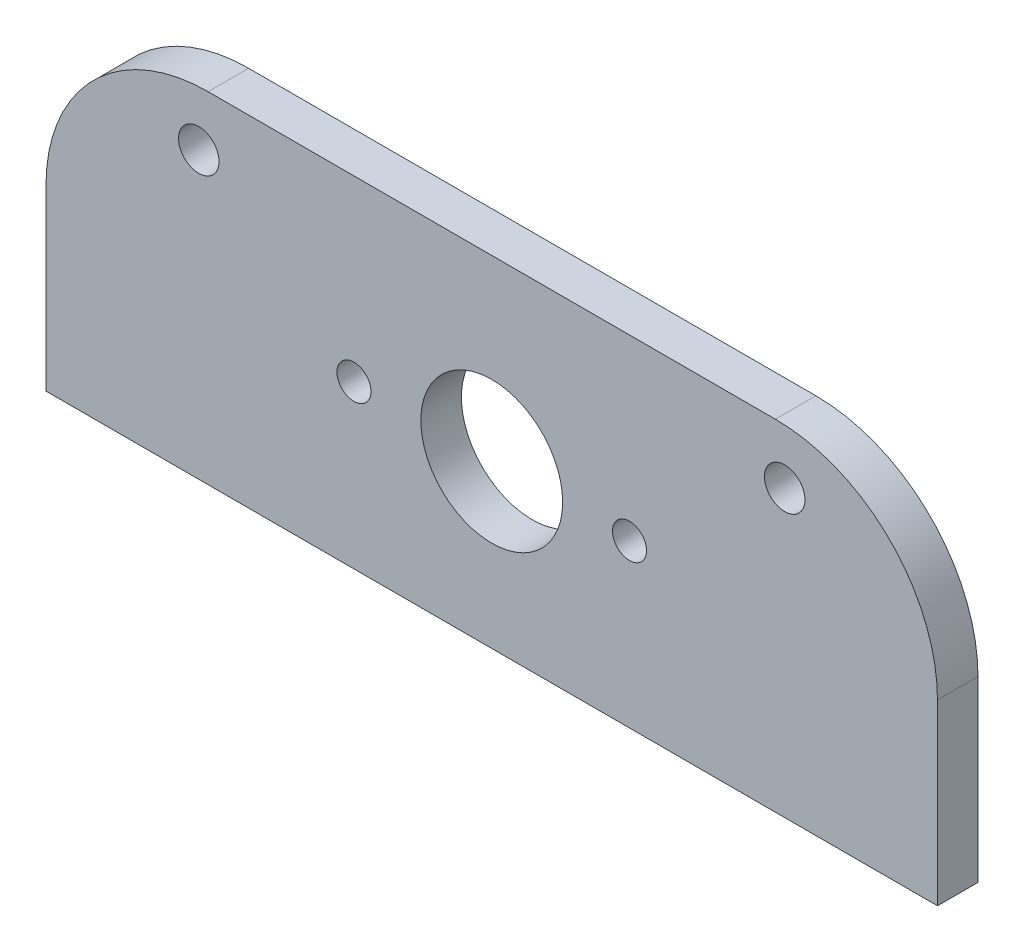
ISO-10303-21;
HEADER;
FILE_DESCRIPTION(('STEP AP214'),'2;1');
FILE_NAME('part.step','',(''),(''),'','','');
FILE_SCHEMA(('AUTOMOTIVE_DESIGN { 1 0 10303 214 1 1 1 1 }'));
ENDSEC;
DATA;
#1=APPLICATION_CONTEXT('core data for automotive mechanical design processes');
#2=APPLICATION_PROTOCOL_DEFINITION('international standard','automotive_design',2000,#1);
#3=PRODUCT_CONTEXT('',#1,'mechanical');
#4=PRODUCT('Part','Part','',(#3));
#5=PRODUCT_RELATED_PRODUCT_CATEGORY('part','',(#4));
#6=PRODUCT_DEFINITION_FORMATION('','',#4);
#7=PRODUCT_DEFINITION_CONTEXT('part definition',#1,'design');
#8=PRODUCT_DEFINITION('design','',#6,#7);
#9=PRODUCT_DEFINITION_SHAPE('','',#8);
#10=(LENGTH_UNIT() NAMED_UNIT(*) SI_UNIT(.MILLI.,.METRE.));
#11=(NAMED_UNIT(*) PLANE_ANGLE_UNIT() SI_UNIT($,.RADIAN.));
#12=(NAMED_UNIT(*) SI_UNIT($,.STERADIAN.) SOLID_ANGLE_UNIT());
#13=UNCERTAINTY_MEASURE_WITH_UNIT(LENGTH_MEASURE(1.E-05),#10,'distance_accuracy_value','');
#14=(GEOMETRIC_REPRESENTATION_CONTEXT(3) GLOBAL_UNCERTAINTY_ASSIGNED_CONTEXT((#13)) GLOBAL_UNIT_ASSIGNED_CONTEXT((#10,
#11,#12)) REPRESENTATION_CONTEXT('',''));
#15=CARTESIAN_POINT('',(0.,0.,0.));
#16=DIRECTION('',(0.,0.,1.));
#17=DIRECTION('',(1.,0.,0.));
#18=AXIS2_PLACEMENT_3D('',#15,#16,#17);
#19=CARTESIAN_POINT('',(0.,0.,2.5));
#20=DIRECTION('',(0.,0.,1.));
#21=DIRECTION('',(1.,0.,0.));
#22=AXIS2_PLACEMENT_3D('',#19,#20,#21);
#23=PLANE('',#22);
#24=CARTESIAN_POINT('',(-17.,0.,2.5));
#25=DIRECTION('',(0.,0.,1.));
#26=DIRECTION('',(1.,0.,0.));
#27=AXIS2_PLACEMENT_3D('',#24,#25,#26);
#28=CIRCLE('',#27,2.1);
#29=CARTESIAN_POINT('',(-14.9,0.,2.5));
#30=VERTEX_POINT('',#29);
#31=EDGE_CURVE('E424',#30,#30,#28,.T.);
#32=ORIENTED_EDGE('',*,*,#31,.F.);
#33=EDGE_LOOP('',(#32));
#34=FACE_BOUND('',#33,.T.);
#35=CARTESIAN_POINT('',(17.,0.,2.5));
#36=DIRECTION('',(0.,0.,1.));
#37=DIRECTION('',(1.,0.,0.));
#38=AXIS2_PLACEMENT_3D('',#35,#36,#37);
#39=CIRCLE('',#38,2.1);
#40=CARTESIAN_POINT('',(19.1,0.,2.5));
#41=VERTEX_POINT('',#40);
#42=EDGE_CURVE('E426',#41,#41,#39,.T.);
#43=ORIENTED_EDGE('',*,*,#42,.F.);
#44=EDGE_LOOP('',(#43));
#45=FACE_BOUND('',#44,.T.);
#46=CARTESIAN_POINT('',(-36.15,15.2,2.5));
#47=DIRECTION('',(0.,0.,1.));
#48=DIRECTION('',(1.,0.,0.));
#49=AXIS2_PLACEMENT_3D('',#46,#47,#48);
#50=CIRCLE('',#49,2.5);
#51=CARTESIAN_POINT('',(-33.65,15.2,2.5));
#52=VERTEX_POINT('',#51);
#53=EDGE_CURVE('E147',#52,#52,#50,.T.);
#54=ORIENTED_EDGE('',*,*,#53,.F.);
#55=EDGE_LOOP('',(#54));
#56=FACE_BOUND('',#55,.T.);
#57=DIRECTION('',(0.,1.,0.));
#58=VECTOR('',#57,1.);
#59=CARTESIAN_POINT('',(55.,22.,2.5));
#60=LINE('',#59,#58);
#61=CARTESIAN_POINT('',(55.,-20.,2.5));
#62=VERTEX_POINT('',#61);
#63=CARTESIAN_POINT('',(55.,2.00000000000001,2.5));
#64=VERTEX_POINT('',#63);
#65=EDGE_CURVE('E164',#62,#64,#60,.T.);
#66=ORIENTED_EDGE('',*,*,#65,.T.);
#67=CARTESIAN_POINT('',(35.,2.00000000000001,2.5));
#68=DIRECTION('',(0.,0.,1.));
#69=DIRECTION('',(1.,0.,0.));
#70=AXIS2_PLACEMENT_3D('',#67,#68,#69);
#71=CIRCLE('',#70,20.);
#72=CARTESIAN_POINT('',(35.,22.,2.5));
#73=VERTEX_POINT('',#72);
#74=EDGE_CURVE('E47',#64,#73,#71,.T.);
#75=ORIENTED_EDGE('',*,*,#74,.T.);
#76=DIRECTION('',(-1.,0.,0.));
#77=VECTOR('',#76,1.);
#78=CARTESIAN_POINT('',(-55.,22.,2.5));
#79=LINE('',#78,#77);
#80=CARTESIAN_POINT('',(-35.,22.,2.5));
#81=VERTEX_POINT('',#80);
#82=EDGE_CURVE('E166',#73,#81,#79,.T.);
#83=ORIENTED_EDGE('',*,*,#82,.T.);
#84=CARTESIAN_POINT('',(-35.,2.,2.5));
#85=DIRECTION('',(0.,0.,1.));
#86=DIRECTION('',(1.,0.,0.));
#87=AXIS2_PLACEMENT_3D('',#84,#85,#86);
#88=CIRCLE('',#87,20.);
#89=CARTESIAN_POINT('',(-55.,1.99999999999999,2.5));
#90=VERTEX_POINT('',#89);
#91=EDGE_CURVE('E54',#81,#90,#88,.T.);
#92=ORIENTED_EDGE('',*,*,#91,.T.);
#93=DIRECTION('',(0.,-1.,0.));
#94=VECTOR('',#93,1.);
#95=CARTESIAN_POINT('',(-55.,22.,2.5));
#96=LINE('',#95,#94);
#97=CARTESIAN_POINT('',(-55.,-20.,2.5));
#98=VERTEX_POINT('',#97);
#99=EDGE_CURVE('E159',#90,#98,#96,.T.);
#100=ORIENTED_EDGE('',*,*,#99,.T.);
#101=DIRECTION('',(1.,0.,0.));
#102=VECTOR('',#101,1.);
#103=CARTESIAN_POINT('',(-55.,-20.,2.5));
#104=LINE('',#103,#102);
#105=EDGE_CURVE('E161',#98,#62,#104,.T.);
#106=ORIENTED_EDGE('',*,*,#105,.T.);
#107=EDGE_LOOP('',(#66,#75,#83,#92,#100,#106));
#108=FACE_BOUND('',#107,.T.);
#109=CARTESIAN_POINT('',(0.,0.,2.5));
#110=DIRECTION('',(0.,0.,1.));
#111=DIRECTION('',(1.,0.,0.));
#112=AXIS2_PLACEMENT_3D('',#109,#110,#111);
#113=CIRCLE('',#112,8.75);
#114=CARTESIAN_POINT('',(8.75,0.,2.5));
#115=VERTEX_POINT('',#114);
#116=EDGE_CURVE('E153',#115,#115,#113,.T.);
#117=ORIENTED_EDGE('',*,*,#116,.F.);
#118=EDGE_LOOP('',(#117));
#119=FACE_BOUND('',#118,.T.);
#120=CARTESIAN_POINT('',(36.15,15.2,2.5));
#121=DIRECTION('',(0.,0.,1.));
#122=DIRECTION('',(1.,0.,0.));
#123=AXIS2_PLACEMENT_3D('',#120,#121,#122);
#124=CIRCLE('',#123,2.5);
#125=CARTESIAN_POINT('',(38.65,15.2,2.5));
#126=VERTEX_POINT('',#125);
#127=EDGE_CURVE('E141',#126,#126,#124,.T.);
#128=ORIENTED_EDGE('',*,*,#127,.F.);
#129=EDGE_LOOP('',(#128));
#130=FACE_BOUND('',#129,.T.);
#131=ADVANCED_FACE('F39',(#34,#45,#56,#108,#119,#130),#23,.T.);
#132=CARTESIAN_POINT('',(0.,0.,-2.5));
#133=DIRECTION('',(0.,0.,1.));
#134=DIRECTION('',(1.,0.,0.));
#135=AXIS2_PLACEMENT_3D('',#132,#133,#134);
#136=PLANE('',#135);
#137=CARTESIAN_POINT('',(-17.,0.,-2.5));
#138=DIRECTION('',(0.,0.,1.));
#139=DIRECTION('',(1.,0.,0.));
#140=AXIS2_PLACEMENT_3D('',#137,#138,#139);
#141=CIRCLE('',#140,2.1);
#142=CARTESIAN_POINT('',(-14.9,0.,-2.5));
#143=VERTEX_POINT('',#142);
#144=EDGE_CURVE('E422',#143,#143,#141,.T.);
#145=ORIENTED_EDGE('',*,*,#144,.T.);
#146=EDGE_LOOP('',(#145));
#147=FACE_BOUND('',#146,.T.);
#148=CARTESIAN_POINT('',(17.,0.,-2.5));
#149=DIRECTION('',(0.,0.,1.));
#150=DIRECTION('',(1.,0.,0.));
#151=AXIS2_PLACEMENT_3D('',#148,#149,#150);
#152=CIRCLE('',#151,2.1);
#153=CARTESIAN_POINT('',(19.1,0.,-2.5));
#154=VERTEX_POINT('',#153);
#155=EDGE_CURVE('E122',#154,#154,#152,.T.);
#156=ORIENTED_EDGE('',*,*,#155,.T.);
#157=EDGE_LOOP('',(#156));
#158=FACE_BOUND('',#157,.T.);
#159=DIRECTION('',(-1.,0.,0.));
#160=VECTOR('',#159,1.);
#161=CARTESIAN_POINT('',(-55.,22.,-2.5));
#162=LINE('',#161,#160);
#163=CARTESIAN_POINT('',(35.,22.,-2.5));
#164=VERTEX_POINT('',#163);
#165=CARTESIAN_POINT('',(-35.,22.,-2.5));
#166=VERTEX_POINT('',#165);
#167=EDGE_CURVE('E162',#164,#166,#162,.T.);
#168=ORIENTED_EDGE('',*,*,#167,.F.);
#169=CARTESIAN_POINT('',(35.,2.00000000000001,-2.5));
#170=DIRECTION('',(0.,0.,1.));
#171=DIRECTION('',(1.,0.,0.));
#172=AXIS2_PLACEMENT_3D('',#169,#170,#171);
#173=CIRCLE('',#172,20.);
#174=CARTESIAN_POINT('',(55.,2.00000000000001,-2.5));
#175=VERTEX_POINT('',#174);
#176=EDGE_CURVE('E188',#164,#175,#173,.F.);
#177=ORIENTED_EDGE('',*,*,#176,.T.);
#178=DIRECTION('',(0.,1.,0.));
#179=VECTOR('',#178,1.);
#180=CARTESIAN_POINT('',(55.,22.,-2.5));
#181=LINE('',#180,#179);
#182=CARTESIAN_POINT('',(55.,-20.,-2.5));
#183=VERTEX_POINT('',#182);
#184=EDGE_CURVE('E172',#183,#175,#181,.T.);
#185=ORIENTED_EDGE('',*,*,#184,.F.);
#186=DIRECTION('',(1.,0.,0.));
#187=VECTOR('',#186,1.);
#188=CARTESIAN_POINT('',(-55.,-20.,-2.5));
#189=LINE('',#188,#187);
#190=CARTESIAN_POINT('',(-55.,-20.,-2.5));
#191=VERTEX_POINT('',#190);
#192=EDGE_CURVE('E170',#191,#183,#189,.T.);
#193=ORIENTED_EDGE('',*,*,#192,.F.);
#194=DIRECTION('',(0.,-1.,0.));
#195=VECTOR('',#194,1.);
#196=CARTESIAN_POINT('',(-55.,22.,-2.5));
#197=LINE('',#196,#195);
#198=CARTESIAN_POINT('',(-55.,1.99999999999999,-2.5));
#199=VERTEX_POINT('',#198);
#200=EDGE_CURVE('E156',#199,#191,#197,.T.);
#201=ORIENTED_EDGE('',*,*,#200,.F.);
#202=CARTESIAN_POINT('',(-35.,2.,-2.5));
#203=DIRECTION('',(0.,0.,1.));
#204=DIRECTION('',(1.,0.,0.));
#205=AXIS2_PLACEMENT_3D('',#202,#203,#204);
#206=CIRCLE('',#205,20.);
#207=EDGE_CURVE('E186',#199,#166,#206,.F.);
#208=ORIENTED_EDGE('',*,*,#207,.T.);
#209=EDGE_LOOP('',(#168,#177,#185,#193,#201,#208));
#210=FACE_BOUND('',#209,.T.);
#211=CARTESIAN_POINT('',(0.,0.,-2.5));
#212=DIRECTION('',(0.,0.,1.));
#213=DIRECTION('',(1.,0.,0.));
#214=AXIS2_PLACEMENT_3D('',#211,#212,#213);
#215=CIRCLE('',#214,8.75);
#216=CARTESIAN_POINT('',(8.75,0.,-2.5));
#217=VERTEX_POINT('',#216);
#218=EDGE_CURVE('E150',#217,#217,#215,.T.);
#219=ORIENTED_EDGE('',*,*,#218,.T.);
#220=EDGE_LOOP('',(#219));
#221=FACE_BOUND('',#220,.T.);
#222=CARTESIAN_POINT('',(-36.15,15.2,-2.5));
#223=DIRECTION('',(0.,0.,1.));
#224=DIRECTION('',(1.,0.,0.));
#225=AXIS2_PLACEMENT_3D('',#222,#223,#224);
#226=CIRCLE('',#225,2.5);
#227=CARTESIAN_POINT('',(-33.65,15.2,-2.5));
#228=VERTEX_POINT('',#227);
#229=EDGE_CURVE('E144',#228,#228,#226,.T.);
#230=ORIENTED_EDGE('',*,*,#229,.T.);
#231=EDGE_LOOP('',(#230));
#232=FACE_BOUND('',#231,.T.);
#233=CARTESIAN_POINT('',(36.15,15.2,-2.5));
#234=DIRECTION('',(0.,0.,1.));
#235=DIRECTION('',(1.,0.,0.));
#236=AXIS2_PLACEMENT_3D('',#233,#234,#235);
#237=CIRCLE('',#236,2.5);
#238=CARTESIAN_POINT('',(38.65,15.2,-2.5));
#239=VERTEX_POINT('',#238);
#240=EDGE_CURVE('E140',#239,#239,#237,.T.);
#241=ORIENTED_EDGE('',*,*,#240,.T.);
#242=EDGE_LOOP('',(#241));
#243=FACE_BOUND('',#242,.T.);
#244=ADVANCED_FACE('F203',(#147,#158,#210,#221,#232,#243),#136,.F.);
#245=CARTESIAN_POINT('',(-55.,22.,2.5));
#246=DIRECTION('',(1.,0.,0.));
#247=DIRECTION('',(0.,1.,0.));
#248=AXIS2_PLACEMENT_3D('',#245,#246,#247);
#249=PLANE('',#248);
#250=ORIENTED_EDGE('',*,*,#99,.F.);
#251=DIRECTION('',(0.,0.,-1.));
#252=VECTOR('',#251,1.);
#253=CARTESIAN_POINT('',(-55.,1.99999999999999,2.5));
#254=LINE('',#253,#252);
#255=EDGE_CURVE('E11',#90,#199,#254,.T.);
#256=ORIENTED_EDGE('',*,*,#255,.T.);
#257=ORIENTED_EDGE('',*,*,#200,.T.);
#258=DIRECTION('',(0.,0.,-1.));
#259=VECTOR('',#258,1.);
#260=CARTESIAN_POINT('',(-55.,-20.,2.5));
#261=LINE('',#260,#259);
#262=EDGE_CURVE('E178',#98,#191,#261,.T.);
#263=ORIENTED_EDGE('',*,*,#262,.F.);
#264=EDGE_LOOP('',(#250,#256,#257,#263));
#265=FACE_BOUND('',#264,.T.);
#266=ADVANCED_FACE('F214',(#265),#249,.F.);
#267=CARTESIAN_POINT('',(-55.,-20.,2.5));
#268=DIRECTION('',(0.,1.,0.));
#269=DIRECTION('',(-1.,0.,0.));
#270=AXIS2_PLACEMENT_3D('',#267,#268,#269);
#271=PLANE('',#270);
#272=CARTESIAN_POINT('',(33.5,-20.,0.));
#273=DIRECTION('',(0.,-1.,0.));
#274=DIRECTION('',(0.,0.,-1.));
#275=AXIS2_PLACEMENT_3D('',#272,#273,#274);
#276=CIRCLE('',#275,1.64999999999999);
#277=CARTESIAN_POINT('',(33.5,-20.,-1.64999999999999));
#278=VERTEX_POINT('',#277);
#279=EDGE_CURVE('E116',#278,#278,#276,.T.);
#280=ORIENTED_EDGE('',*,*,#279,.F.);
#281=EDGE_LOOP('',(#280));
#282=FACE_BOUND('',#281,.T.);
#283=CARTESIAN_POINT('',(-33.5,-20.,0.));
#284=DIRECTION('',(0.,-1.,0.));
#285=DIRECTION('',(0.,0.,-1.));
#286=AXIS2_PLACEMENT_3D('',#283,#284,#285);
#287=CIRCLE('',#286,1.64999999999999);
#288=CARTESIAN_POINT('',(-33.5,-20.,-1.64999999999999));
#289=VERTEX_POINT('',#288);
#290=EDGE_CURVE('E115',#289,#289,#287,.T.);
#291=ORIENTED_EDGE('',*,*,#290,.F.);
#292=EDGE_LOOP('',(#291));
#293=FACE_BOUND('',#292,.T.);
#294=CARTESIAN_POINT('',(20.,-20.,0.));
#295=DIRECTION('',(0.,-1.,0.));
#296=DIRECTION('',(0.,0.,-1.));
#297=AXIS2_PLACEMENT_3D('',#294,#295,#296);
#298=CIRCLE('',#297,1.99999999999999);
#299=CARTESIAN_POINT('',(20.,-20.,-1.99999999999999));
#300=VERTEX_POINT('',#299);
#301=EDGE_CURVE('E128',#300,#300,#298,.T.);
#302=ORIENTED_EDGE('',*,*,#301,.F.);
#303=EDGE_LOOP('',(#302));
#304=FACE_BOUND('',#303,.T.);
#305=CARTESIAN_POINT('',(-20.,-20.,0.));
#306=DIRECTION('',(0.,-1.,0.));
#307=DIRECTION('',(0.,0.,-1.));
#308=AXIS2_PLACEMENT_3D('',#305,#306,#307);
#309=CIRCLE('',#308,1.99999999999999);
#310=CARTESIAN_POINT('',(-20.,-20.,-1.99999999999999));
#311=VERTEX_POINT('',#310);
#312=EDGE_CURVE('E134',#311,#311,#309,.T.);
#313=ORIENTED_EDGE('',*,*,#312,.F.);
#314=EDGE_LOOP('',(#313));
#315=FACE_BOUND('',#314,.T.);
#316=ORIENTED_EDGE('',*,*,#192,.T.);
#317=DIRECTION('',(0.,0.,-1.));
#318=VECTOR('',#317,1.);
#319=CARTESIAN_POINT('',(55.,-20.,2.5));
#320=LINE('',#319,#318);
#321=EDGE_CURVE('E168',#62,#183,#320,.T.);
#322=ORIENTED_EDGE('',*,*,#321,.F.);
#323=ORIENTED_EDGE('',*,*,#105,.F.);
#324=ORIENTED_EDGE('',*,*,#262,.T.);
#325=EDGE_LOOP('',(#316,#322,#323,#324));
#326=FACE_BOUND('',#325,.T.);
#327=ADVANCED_FACE('F210',(#282,#293,#304,#315,#326),#271,.F.);
#328=CARTESIAN_POINT('',(55.,22.,2.5));
#329=DIRECTION('',(-1.,0.,0.));
#330=DIRECTION('',(0.,0.,1.));
#331=AXIS2_PLACEMENT_3D('',#328,#329,#330);
#332=PLANE('',#331);
#333=ORIENTED_EDGE('',*,*,#184,.T.);
#334=DIRECTION('',(0.,0.,-1.));
#335=VECTOR('',#334,1.);
#336=CARTESIAN_POINT('',(55.,2.00000000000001,2.5));
#337=LINE('',#336,#335);
#338=EDGE_CURVE('E62',#175,#64,#337,.F.);
#339=ORIENTED_EDGE('',*,*,#338,.T.);
#340=ORIENTED_EDGE('',*,*,#65,.F.);
#341=ORIENTED_EDGE('',*,*,#321,.T.);
#342=EDGE_LOOP('',(#333,#339,#340,#341));
#343=FACE_BOUND('',#342,.T.);
#344=ADVANCED_FACE('F206',(#343),#332,.F.);
#345=CARTESIAN_POINT('',(-55.,22.,2.5));
#346=DIRECTION('',(0.,-1.,0.));
#347=DIRECTION('',(1.,0.,0.));
#348=AXIS2_PLACEMENT_3D('',#345,#346,#347);
#349=PLANE('',#348);
#350=ORIENTED_EDGE('',*,*,#82,.F.);
#351=DIRECTION('',(0.,0.,-1.));
#352=VECTOR('',#351,1.);
#353=CARTESIAN_POINT('',(35.,22.,2.5));
#354=LINE('',#353,#352);
#355=EDGE_CURVE('E183',#73,#164,#354,.T.);
#356=ORIENTED_EDGE('',*,*,#355,.T.);
#357=ORIENTED_EDGE('',*,*,#167,.T.);
#358=DIRECTION('',(0.,0.,-1.));
#359=VECTOR('',#358,1.);
#360=CARTESIAN_POINT('',(-35.,22.,2.5));
#361=LINE('',#360,#359);
#362=EDGE_CURVE('E181',#166,#81,#361,.F.);
#363=ORIENTED_EDGE('',*,*,#362,.T.);
#364=EDGE_LOOP('',(#350,#356,#357,#363));
#365=FACE_BOUND('',#364,.T.);
#366=ADVANCED_FACE('F197',(#365),#349,.F.);
#367=CARTESIAN_POINT('',(0.,0.,2.5));
#368=DIRECTION('',(0.,0.,-1.));
#369=DIRECTION('',(-1.,0.,0.));
#370=AXIS2_PLACEMENT_3D('',#367,#368,#369);
#371=CYLINDRICAL_SURFACE('',#370,8.75);
#372=ORIENTED_EDGE('',*,*,#116,.T.);
#373=EDGE_LOOP('',(#372));
#374=FACE_BOUND('',#373,.T.);
#375=ORIENTED_EDGE('',*,*,#218,.F.);
#376=EDGE_LOOP('',(#375));
#377=FACE_BOUND('',#376,.T.);
#378=ADVANCED_FACE('F238',(#374,#377),#371,.F.);
#379=CARTESIAN_POINT('',(-36.15,15.2,2.5));
#380=DIRECTION('',(0.,0.,-1.));
#381=DIRECTION('',(-1.,0.,0.));
#382=AXIS2_PLACEMENT_3D('',#379,#380,#381);
#383=CYLINDRICAL_SURFACE('',#382,2.5);
#384=ORIENTED_EDGE('',*,*,#53,.T.);
#385=EDGE_LOOP('',(#384));
#386=FACE_BOUND('',#385,.T.);
#387=ORIENTED_EDGE('',*,*,#229,.F.);
#388=EDGE_LOOP('',(#387));
#389=FACE_BOUND('',#388,.T.);
#390=ADVANCED_FACE('F275',(#386,#389),#383,.F.);
#391=CARTESIAN_POINT('',(36.15,15.2,2.5));
#392=DIRECTION('',(0.,0.,-1.));
#393=DIRECTION('',(-1.,0.,0.));
#394=AXIS2_PLACEMENT_3D('',#391,#392,#393);
#395=CYLINDRICAL_SURFACE('',#394,2.5);
#396=ORIENTED_EDGE('',*,*,#127,.T.);
#397=EDGE_LOOP('',(#396));
#398=FACE_BOUND('',#397,.T.);
#399=ORIENTED_EDGE('',*,*,#240,.F.);
#400=EDGE_LOOP('',(#399));
#401=FACE_BOUND('',#400,.T.);
#402=ADVANCED_FACE('F226',(#398,#401),#395,.F.);
#403=CARTESIAN_POINT('',(35.,2.00000000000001,2.5));
#404=DIRECTION('',(0.,0.,-1.));
#405=DIRECTION('',(-1.,0.,0.));
#406=AXIS2_PLACEMENT_3D('',#403,#404,#405);
#407=CYLINDRICAL_SURFACE('',#406,20.);
#408=ORIENTED_EDGE('',*,*,#74,.F.);
#409=ORIENTED_EDGE('',*,*,#338,.F.);
#410=ORIENTED_EDGE('',*,*,#176,.F.);
#411=ORIENTED_EDGE('',*,*,#355,.F.);
#412=EDGE_LOOP('',(#408,#409,#410,#411));
#413=FACE_BOUND('',#412,.T.);
#414=ADVANCED_FACE('F200',(#413),#407,.T.);
#415=CARTESIAN_POINT('',(-35.,2.,2.5));
#416=DIRECTION('',(0.,0.,-1.));
#417=DIRECTION('',(-1.,0.,0.));
#418=AXIS2_PLACEMENT_3D('',#415,#416,#417);
#419=CYLINDRICAL_SURFACE('',#418,20.);
#420=ORIENTED_EDGE('',*,*,#91,.F.);
#421=ORIENTED_EDGE('',*,*,#362,.F.);
#422=ORIENTED_EDGE('',*,*,#207,.F.);
#423=ORIENTED_EDGE('',*,*,#255,.F.);
#424=EDGE_LOOP('',(#420,#421,#422,#423));
#425=FACE_BOUND('',#424,.T.);
#426=ADVANCED_FACE('F41',(#425),#419,.T.);
#427=CARTESIAN_POINT('',(-20.,-16.,0.));
#428=DIRECTION('',(0.,-1.,0.));
#429=DIRECTION('',(0.,0.,-1.));
#430=AXIS2_PLACEMENT_3D('',#427,#428,#429);
#431=CONICAL_SURFACE('',#430,2.,1.02974425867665);
#432=CARTESIAN_POINT('',(-20.,-14.7982787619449,0.));
#433=VERTEX_POINT('',#432);
#434=VERTEX_LOOP('',#433);
#435=FACE_BOUND('',#434,.T.);
#436=CARTESIAN_POINT('',(-20.,-16.,0.));
#437=DIRECTION('',(0.,-1.,0.));
#438=DIRECTION('',(0.,0.,-1.));
#439=AXIS2_PLACEMENT_3D('',#436,#437,#438);
#440=CIRCLE('',#439,2.);
#441=CARTESIAN_POINT('',(-20.,-16.,-2.));
#442=VERTEX_POINT('',#441);
#443=EDGE_CURVE('E137',#442,#442,#440,.T.);
#444=ORIENTED_EDGE('',*,*,#443,.T.);
#445=EDGE_LOOP('',(#444));
#446=FACE_BOUND('',#445,.T.);
#447=ADVANCED_FACE('F218',(#435,#446),#431,.F.);
#448=CARTESIAN_POINT('',(-20.,-20.,0.));
#449=DIRECTION('',(0.,-1.,0.));
#450=DIRECTION('',(0.,0.,-1.));
#451=AXIS2_PLACEMENT_3D('',#448,#449,#450);
#452=CYLINDRICAL_SURFACE('',#451,1.99999999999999);
#453=ORIENTED_EDGE('',*,*,#443,.F.);
#454=EDGE_LOOP('',(#453));
#455=FACE_BOUND('',#454,.T.);
#456=ORIENTED_EDGE('',*,*,#312,.T.);
#457=EDGE_LOOP('',(#456));
#458=FACE_BOUND('',#457,.T.);
#459=ADVANCED_FACE('F223',(#455,#458),#452,.F.);
#460=CARTESIAN_POINT('',(20.,-16.,0.));
#461=DIRECTION('',(0.,-1.,0.));
#462=DIRECTION('',(0.,0.,-1.));
#463=AXIS2_PLACEMENT_3D('',#460,#461,#462);
#464=CONICAL_SURFACE('',#463,2.,1.02974425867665);
#465=CARTESIAN_POINT('',(20.,-14.7982787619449,0.));
#466=VERTEX_POINT('',#465);
#467=VERTEX_LOOP('',#466);
#468=FACE_BOUND('',#467,.T.);
#469=CARTESIAN_POINT('',(20.,-16.,0.));
#470=DIRECTION('',(0.,-1.,0.));
#471=DIRECTION('',(0.,0.,-1.));
#472=AXIS2_PLACEMENT_3D('',#469,#470,#471);
#473=CIRCLE('',#472,2.);
#474=CARTESIAN_POINT('',(20.,-16.,-2.));
#475=VERTEX_POINT('',#474);
#476=EDGE_CURVE('E131',#475,#475,#473,.T.);
#477=ORIENTED_EDGE('',*,*,#476,.T.);
#478=EDGE_LOOP('',(#477));
#479=FACE_BOUND('',#478,.T.);
#480=ADVANCED_FACE('F310',(#468,#479),#464,.F.);
#481=CARTESIAN_POINT('',(20.,-20.,0.));
#482=DIRECTION('',(0.,-1.,0.));
#483=DIRECTION('',(0.,0.,-1.));
#484=AXIS2_PLACEMENT_3D('',#481,#482,#483);
#485=CYLINDRICAL_SURFACE('',#484,1.99999999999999);
#486=ORIENTED_EDGE('',*,*,#476,.F.);
#487=EDGE_LOOP('',(#486));
#488=FACE_BOUND('',#487,.T.);
#489=ORIENTED_EDGE('',*,*,#301,.T.);
#490=EDGE_LOOP('',(#489));
#491=FACE_BOUND('',#490,.T.);
#492=ADVANCED_FACE('F319',(#488,#491),#485,.F.);
#493=CARTESIAN_POINT('',(-33.5,-8.5,0.));
#494=DIRECTION('',(0.,-1.,0.));
#495=DIRECTION('',(0.,0.,-1.));
#496=AXIS2_PLACEMENT_3D('',#493,#494,#495);
#497=CONICAL_SURFACE('',#496,1.64999999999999,1.02974425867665);
#498=CARTESIAN_POINT('',(-33.5,-7.50857997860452,0.));
#499=VERTEX_POINT('',#498);
#500=VERTEX_LOOP('',#499);
#501=FACE_BOUND('',#500,.T.);
#502=CARTESIAN_POINT('',(-33.5,-8.5,0.));
#503=DIRECTION('',(0.,-1.,0.));
#504=DIRECTION('',(0.,0.,-1.));
#505=AXIS2_PLACEMENT_3D('',#502,#503,#504);
#506=CIRCLE('',#505,1.64999999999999);
#507=CARTESIAN_POINT('',(-33.5,-8.5,-1.64999999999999));
#508=VERTEX_POINT('',#507);
#509=EDGE_CURVE('E119',#508,#508,#506,.T.);
#510=ORIENTED_EDGE('',*,*,#509,.T.);
#511=EDGE_LOOP('',(#510));
#512=FACE_BOUND('',#511,.T.);
#513=ADVANCED_FACE('F328',(#501,#512),#497,.F.);
#514=CARTESIAN_POINT('',(-33.5,-20.,0.));
#515=DIRECTION('',(0.,-1.,0.));
#516=DIRECTION('',(0.,0.,-1.));
#517=AXIS2_PLACEMENT_3D('',#514,#515,#516);
#518=CYLINDRICAL_SURFACE('',#517,1.64999999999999);
#519=ORIENTED_EDGE('',*,*,#509,.F.);
#520=EDGE_LOOP('',(#519));
#521=FACE_BOUND('',#520,.T.);
#522=ORIENTED_EDGE('',*,*,#290,.T.);
#523=EDGE_LOOP('',(#522));
#524=FACE_BOUND('',#523,.T.);
#525=ADVANCED_FACE('F109',(#521,#524),#518,.F.);
#526=CARTESIAN_POINT('',(33.5,-8.49999999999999,0.));
#527=DIRECTION('',(0.,-1.,0.));
#528=DIRECTION('',(0.,0.,-1.));
#529=AXIS2_PLACEMENT_3D('',#526,#527,#528);
#530=CONICAL_SURFACE('',#529,1.64999999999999,1.02974425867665);
#531=CARTESIAN_POINT('',(33.5,-7.50857997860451,0.));
#532=VERTEX_POINT('',#531);
#533=VERTEX_LOOP('',#532);
#534=FACE_BOUND('',#533,.T.);
#535=CARTESIAN_POINT('',(33.5,-8.49999999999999,0.));
#536=DIRECTION('',(0.,-1.,0.));
#537=DIRECTION('',(0.,0.,-1.));
#538=AXIS2_PLACEMENT_3D('',#535,#536,#537);
#539=CIRCLE('',#538,1.64999999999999);
#540=CARTESIAN_POINT('',(33.5,-8.49999999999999,-1.64999999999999));
#541=VERTEX_POINT('',#540);
#542=EDGE_CURVE('E113',#541,#541,#539,.T.);
#543=ORIENTED_EDGE('',*,*,#542,.T.);
#544=EDGE_LOOP('',(#543));
#545=FACE_BOUND('',#544,.T.);
#546=ADVANCED_FACE('F105',(#534,#545),#530,.F.);
#547=CARTESIAN_POINT('',(33.5,-20.,0.));
#548=DIRECTION('',(0.,-1.,0.));
#549=DIRECTION('',(0.,0.,-1.));
#550=AXIS2_PLACEMENT_3D('',#547,#548,#549);
#551=CYLINDRICAL_SURFACE('',#550,1.64999999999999);
#552=ORIENTED_EDGE('',*,*,#542,.F.);
#553=EDGE_LOOP('',(#552));
#554=FACE_BOUND('',#553,.T.);
#555=ORIENTED_EDGE('',*,*,#279,.T.);
#556=EDGE_LOOP('',(#555));
#557=FACE_BOUND('',#556,.T.);
#558=ADVANCED_FACE('F108',(#554,#557),#551,.F.);
#559=CARTESIAN_POINT('',(17.,0.,2.5));
#560=DIRECTION('',(0.,0.,1.));
#561=DIRECTION('',(1.,0.,0.));
#562=AXIS2_PLACEMENT_3D('',#559,#560,#561);
#563=CYLINDRICAL_SURFACE('',#562,2.1);
#564=ORIENTED_EDGE('',*,*,#155,.F.);
#565=EDGE_LOOP('',(#564));
#566=FACE_BOUND('',#565,.T.);
#567=ORIENTED_EDGE('',*,*,#42,.T.);
#568=EDGE_LOOP('',(#567));
#569=FACE_BOUND('',#568,.T.);
#570=ADVANCED_FACE('F357',(#566,#569),#563,.F.);
#571=CARTESIAN_POINT('',(-17.,0.,2.5));
#572=DIRECTION('',(0.,0.,1.));
#573=DIRECTION('',(1.,0.,0.));
#574=AXIS2_PLACEMENT_3D('',#571,#572,#573);
#575=CYLINDRICAL_SURFACE('',#574,2.1);
#576=ORIENTED_EDGE('',*,*,#144,.F.);
#577=EDGE_LOOP('',(#576));
#578=FACE_BOUND('',#577,.T.);
#579=ORIENTED_EDGE('',*,*,#31,.T.);
#580=EDGE_LOOP('',(#579));
#581=FACE_BOUND('',#580,.T.);
#582=ADVANCED_FACE('F364',(#578,#581),#575,.F.);
#583=CLOSED_SHELL('',(#131,#244,#266,#327,#344,#366,#378,#390,#402,#414,#426,#447,#459,#480,
#492,#513,#525,#546,#558,#570,#582));
#584=MANIFOLD_SOLID_BREP('B2',#583);
#585=ADVANCED_BREP_SHAPE_REPRESENTATION('',(#18,#584),#14);
#586=SHAPE_DEFINITION_REPRESENTATION(#9,#585);
ENDSEC;
END-ISO-10303-21;
